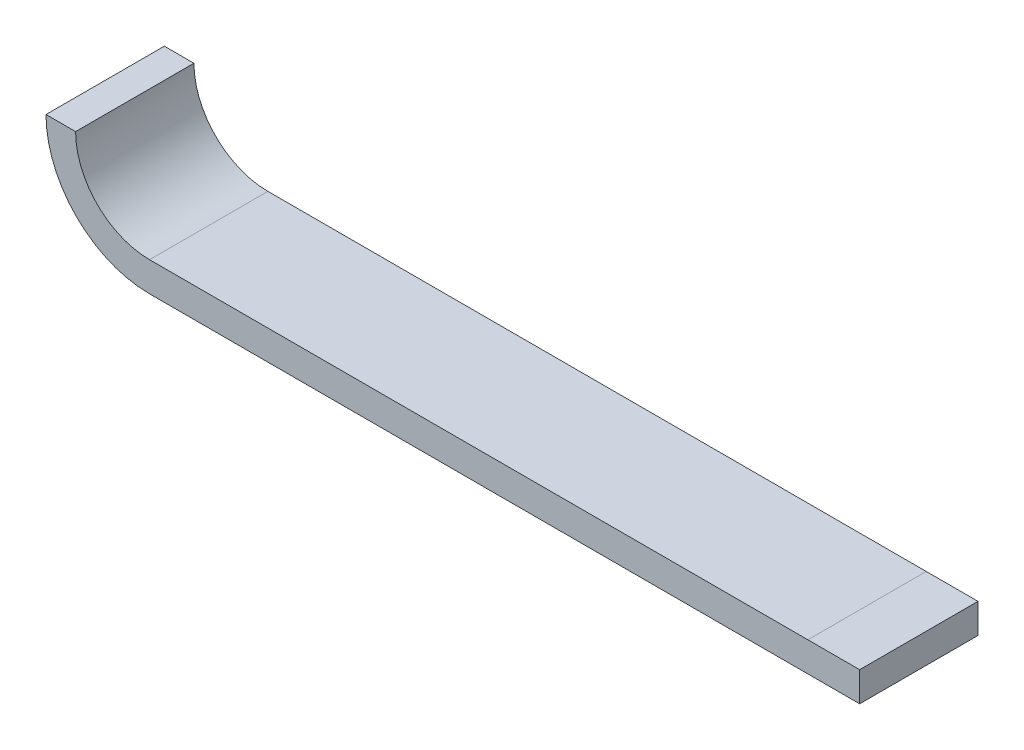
from build123d import *

# Parameters (mm, degrees)
SKETCH2_W = 50.8
SKETCH2_H = 12.7


with BuildPart() as part:
    # Base-Sweep: sweep along a path in Sketch1
    with BuildLine(Plane.XY) as base_sweep_path:
        Line((304.8, -38.1), (0, -38.1))
        ThreePointArc((0, -38.1), (-26.940768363, -26.940768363), (-38.1, 0))
    # Sketch2 → Base-Sweep (sweep)
    with BuildSketch(Plane(origin=(304.8, 0, 0), x_dir=(0, 0, -1), z_dir=(1, 0, 0))):
        with Locations((0, -38.1)):
            Rectangle(SKETCH2_W, SKETCH2_H)
    sweep(path=base_sweep_path.line)


solid = part.part
